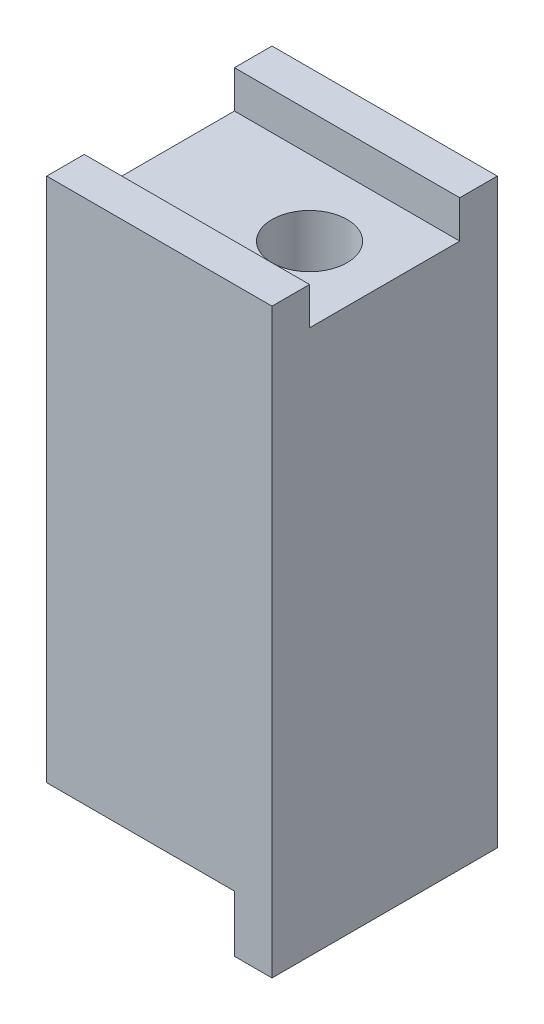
ISO-10303-21;
HEADER;
FILE_DESCRIPTION(('STEP AP214'),'2;1');
FILE_NAME('part.step','',(''),(''),'','','');
FILE_SCHEMA(('AUTOMOTIVE_DESIGN { 1 0 10303 214 1 1 1 1 }'));
ENDSEC;
DATA;
#1=APPLICATION_CONTEXT('core data for automotive mechanical design processes');
#2=APPLICATION_PROTOCOL_DEFINITION('international standard','automotive_design',2000,#1);
#3=PRODUCT_CONTEXT('',#1,'mechanical');
#4=PRODUCT('Part','Part','',(#3));
#5=PRODUCT_RELATED_PRODUCT_CATEGORY('part','',(#4));
#6=PRODUCT_DEFINITION_FORMATION('','',#4);
#7=PRODUCT_DEFINITION_CONTEXT('part definition',#1,'design');
#8=PRODUCT_DEFINITION('design','',#6,#7);
#9=PRODUCT_DEFINITION_SHAPE('','',#8);
#10=(LENGTH_UNIT() NAMED_UNIT(*) SI_UNIT(.MILLI.,.METRE.));
#11=(NAMED_UNIT(*) PLANE_ANGLE_UNIT() SI_UNIT($,.RADIAN.));
#12=(NAMED_UNIT(*) SI_UNIT($,.STERADIAN.) SOLID_ANGLE_UNIT());
#13=UNCERTAINTY_MEASURE_WITH_UNIT(LENGTH_MEASURE(1.E-05),#10,'distance_accuracy_value','');
#14=(GEOMETRIC_REPRESENTATION_CONTEXT(3) GLOBAL_UNCERTAINTY_ASSIGNED_CONTEXT((#13)) GLOBAL_UNIT_ASSIGNED_CONTEXT((#10,
#11,#12)) REPRESENTATION_CONTEXT('',''));
#15=CARTESIAN_POINT('',(0.,0.,0.));
#16=DIRECTION('',(0.,0.,1.));
#17=DIRECTION('',(1.,0.,0.));
#18=AXIS2_PLACEMENT_3D('',#15,#16,#17);
#19=CARTESIAN_POINT('',(-9.525,0.,9.525));
#20=DIRECTION('',(0.,-1.,0.));
#21=DIRECTION('',(0.,0.,-1.));
#22=AXIS2_PLACEMENT_3D('',#19,#20,#21);
#23=PLANE('',#22);
#24=DIRECTION('',(-1.,0.,0.));
#25=VECTOR('',#24,1.);
#26=CARTESIAN_POINT('',(-9.525,0.,6.35));
#27=LINE('',#26,#25);
#28=CARTESIAN_POINT('',(9.525,0.,6.35));
#29=VERTEX_POINT('',#28);
#30=CARTESIAN_POINT('',(-9.525,0.,6.35));
#31=VERTEX_POINT('',#30);
#32=EDGE_CURVE('E179',#29,#31,#27,.T.);
#33=ORIENTED_EDGE('',*,*,#32,.T.);
#34=DIRECTION('',(0.,0.,-1.));
#35=VECTOR('',#34,1.);
#36=CARTESIAN_POINT('',(-9.525,0.,9.525));
#37=LINE('',#36,#35);
#38=CARTESIAN_POINT('',(-9.525,0.,9.525));
#39=VERTEX_POINT('',#38);
#40=EDGE_CURVE('E147',#39,#31,#37,.T.);
#41=ORIENTED_EDGE('',*,*,#40,.F.);
#42=DIRECTION('',(-1.,0.,0.));
#43=VECTOR('',#42,1.);
#44=CARTESIAN_POINT('',(0.,0.,9.525));
#45=LINE('',#44,#43);
#46=CARTESIAN_POINT('',(9.525,0.,9.525));
#47=VERTEX_POINT('',#46);
#48=EDGE_CURVE('E92',#47,#39,#45,.T.);
#49=ORIENTED_EDGE('',*,*,#48,.F.);
#50=DIRECTION('',(0.,0.,-1.));
#51=VECTOR('',#50,1.);
#52=CARTESIAN_POINT('',(9.525,0.,9.525));
#53=LINE('',#52,#51);
#54=EDGE_CURVE('E11',#47,#29,#53,.T.);
#55=ORIENTED_EDGE('',*,*,#54,.T.);
#56=EDGE_LOOP('',(#33,#41,#49,#55));
#57=FACE_BOUND('',#56,.T.);
#58=ADVANCED_FACE('F33',(#57),#23,.F.);
#59=CARTESIAN_POINT('',(9.525,0.,9.525));
#60=DIRECTION('',(-1.,0.,0.));
#61=DIRECTION('',(0.,-1.,0.));
#62=AXIS2_PLACEMENT_3D('',#59,#60,#61);
#63=PLANE('',#62);
#64=CARTESIAN_POINT('',(9.525,0.,-6.35));
#65=VERTEX_POINT('',#64);
#66=CARTESIAN_POINT('',(9.525,0.,-9.525));
#67=VERTEX_POINT('',#66);
#68=EDGE_CURVE('E41',#65,#67,#53,.T.);
#69=ORIENTED_EDGE('',*,*,#68,.F.);
#70=DIRECTION('',(0.,1.,0.));
#71=VECTOR('',#70,1.);
#72=CARTESIAN_POINT('',(9.525,0.,-6.35));
#73=LINE('',#72,#71);
#74=CARTESIAN_POINT('',(9.525,-3.175,-6.35));
#75=VERTEX_POINT('',#74);
#76=EDGE_CURVE('E190',#75,#65,#73,.T.);
#77=ORIENTED_EDGE('',*,*,#76,.F.);
#78=DIRECTION('',(0.,0.,1.));
#79=VECTOR('',#78,1.);
#80=CARTESIAN_POINT('',(9.525,-3.175,-6.35));
#81=LINE('',#80,#79);
#82=CARTESIAN_POINT('',(9.525,-3.175,6.35));
#83=VERTEX_POINT('',#82);
#84=EDGE_CURVE('E134',#75,#83,#81,.T.);
#85=ORIENTED_EDGE('',*,*,#84,.T.);
#86=DIRECTION('',(0.,1.,0.));
#87=VECTOR('',#86,1.);
#88=CARTESIAN_POINT('',(9.525,0.,6.35));
#89=LINE('',#88,#87);
#90=EDGE_CURVE('E182',#83,#29,#89,.T.);
#91=ORIENTED_EDGE('',*,*,#90,.T.);
#92=ORIENTED_EDGE('',*,*,#54,.F.);
#93=DIRECTION('',(0.,1.,0.));
#94=VECTOR('',#93,1.);
#95=CARTESIAN_POINT('',(9.525,0.,9.525));
#96=LINE('',#95,#94);
#97=CARTESIAN_POINT('',(9.52500000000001,-49.1998,9.525));
#98=VERTEX_POINT('',#97);
#99=EDGE_CURVE('E143',#98,#47,#96,.T.);
#100=ORIENTED_EDGE('',*,*,#99,.F.);
#101=DIRECTION('',(0.,0.,-1.));
#102=VECTOR('',#101,1.);
#103=CARTESIAN_POINT('',(9.52500000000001,-49.1998,9.525));
#104=LINE('',#103,#102);
#105=CARTESIAN_POINT('',(9.52500000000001,-49.1998,-9.525));
#106=VERTEX_POINT('',#105);
#107=EDGE_CURVE('E126',#98,#106,#104,.T.);
#108=ORIENTED_EDGE('',*,*,#107,.T.);
#109=DIRECTION('',(0.,1.,0.));
#110=VECTOR('',#109,1.);
#111=CARTESIAN_POINT('',(9.525,0.,-9.525));
#112=LINE('',#111,#110);
#113=EDGE_CURVE('E130',#106,#67,#112,.T.);
#114=ORIENTED_EDGE('',*,*,#113,.T.);
#115=EDGE_LOOP('',(#69,#77,#85,#91,#92,#100,#108,#114));
#116=FACE_BOUND('',#115,.T.);
#117=ADVANCED_FACE('F35',(#116),#63,.F.);
#118=CARTESIAN_POINT('',(-9.525,0.,-6.35));
#119=VERTEX_POINT('',#118);
#120=CARTESIAN_POINT('',(-9.525,0.,-9.525));
#121=VERTEX_POINT('',#120);
#122=EDGE_CURVE('E146',#119,#121,#37,.T.);
#123=ORIENTED_EDGE('',*,*,#122,.F.);
#124=DIRECTION('',(-1.,0.,0.));
#125=VECTOR('',#124,1.);
#126=CARTESIAN_POINT('',(0.,0.,-6.35));
#127=LINE('',#126,#125);
#128=EDGE_CURVE('E176',#65,#119,#127,.T.);
#129=ORIENTED_EDGE('',*,*,#128,.F.);
#130=ORIENTED_EDGE('',*,*,#68,.T.);
#131=DIRECTION('',(-1.,0.,0.));
#132=VECTOR('',#131,1.);
#133=CARTESIAN_POINT('',(-9.525,0.,-9.525));
#134=LINE('',#133,#132);
#135=EDGE_CURVE('E133',#67,#121,#134,.T.);
#136=ORIENTED_EDGE('',*,*,#135,.T.);
#137=EDGE_LOOP('',(#123,#129,#130,#136));
#138=FACE_BOUND('',#137,.T.);
#139=ADVANCED_FACE('F161',(#138),#23,.F.);
#140=CARTESIAN_POINT('',(-9.525,-44.4246,9.525));
#141=DIRECTION('',(1.,0.,0.));
#142=DIRECTION('',(0.,1.,0.));
#143=AXIS2_PLACEMENT_3D('',#140,#141,#142);
#144=PLANE('',#143);
#145=DIRECTION('',(0.,0.,1.));
#146=VECTOR('',#145,1.);
#147=CARTESIAN_POINT('',(-9.525,-3.175,-6.35));
#148=LINE('',#147,#146);
#149=CARTESIAN_POINT('',(-9.525,-3.175,-6.35));
#150=VERTEX_POINT('',#149);
#151=CARTESIAN_POINT('',(-9.525,-3.175,6.35));
#152=VERTEX_POINT('',#151);
#153=EDGE_CURVE('E174',#150,#152,#148,.T.);
#154=ORIENTED_EDGE('',*,*,#153,.F.);
#155=DIRECTION('',(0.,-1.,0.));
#156=VECTOR('',#155,1.);
#157=CARTESIAN_POINT('',(-9.525,-3.175,-6.35));
#158=LINE('',#157,#156);
#159=EDGE_CURVE('E157',#119,#150,#158,.T.);
#160=ORIENTED_EDGE('',*,*,#159,.F.);
#161=ORIENTED_EDGE('',*,*,#122,.T.);
#162=DIRECTION('',(0.,-1.,0.));
#163=VECTOR('',#162,1.);
#164=CARTESIAN_POINT('',(-9.525,-44.4246,-9.525));
#165=LINE('',#164,#163);
#166=CARTESIAN_POINT('',(-9.525,-44.4246,-9.525));
#167=VERTEX_POINT('',#166);
#168=EDGE_CURVE('E137',#121,#167,#165,.T.);
#169=ORIENTED_EDGE('',*,*,#168,.T.);
#170=DIRECTION('',(0.,0.,-1.));
#171=VECTOR('',#170,1.);
#172=CARTESIAN_POINT('',(-9.525,-44.4246,9.525));
#173=LINE('',#172,#171);
#174=CARTESIAN_POINT('',(-9.525,-44.4246,9.525));
#175=VERTEX_POINT('',#174);
#176=EDGE_CURVE('E121',#175,#167,#173,.T.);
#177=ORIENTED_EDGE('',*,*,#176,.F.);
#178=DIRECTION('',(0.,-1.,0.));
#179=VECTOR('',#178,1.);
#180=CARTESIAN_POINT('',(-9.525,-44.4246,9.525));
#181=LINE('',#180,#179);
#182=EDGE_CURVE('E109',#39,#175,#181,.T.);
#183=ORIENTED_EDGE('',*,*,#182,.F.);
#184=ORIENTED_EDGE('',*,*,#40,.T.);
#185=DIRECTION('',(0.,-1.,0.));
#186=VECTOR('',#185,1.);
#187=CARTESIAN_POINT('',(-9.525,-3.175,6.35));
#188=LINE('',#187,#186);
#189=EDGE_CURVE('E185',#31,#152,#188,.T.);
#190=ORIENTED_EDGE('',*,*,#189,.T.);
#191=EDGE_LOOP('',(#154,#160,#161,#169,#177,#183,#184,#190));
#192=FACE_BOUND('',#191,.T.);
#193=ADVANCED_FACE('F154',(#192),#144,.F.);
#194=CARTESIAN_POINT('',(6.35000000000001,-44.4246,9.525));
#195=DIRECTION('',(0.,1.,0.));
#196=DIRECTION('',(0.,0.,1.));
#197=AXIS2_PLACEMENT_3D('',#194,#195,#196);
#198=PLANE('',#197);
#199=CARTESIAN_POINT('',(-3.17499999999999,-44.4246,0.));
#200=DIRECTION('',(0.,-1.,0.));
#201=DIRECTION('',(0.,0.,-1.));
#202=AXIS2_PLACEMENT_3D('',#199,#200,#201);
#203=CIRCLE('',#202,3.17499999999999);
#204=CARTESIAN_POINT('',(-3.17499999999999,-44.4246,-3.17499999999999));
#205=VERTEX_POINT('',#204);
#206=EDGE_CURVE('E217',#205,#205,#203,.T.);
#207=ORIENTED_EDGE('',*,*,#206,.F.);
#208=EDGE_LOOP('',(#207));
#209=FACE_BOUND('',#208,.T.);
#210=DIRECTION('',(1.,0.,0.));
#211=VECTOR('',#210,1.);
#212=CARTESIAN_POINT('',(6.35000000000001,-44.4246,-9.525));
#213=LINE('',#212,#211);
#214=CARTESIAN_POINT('',(6.35000000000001,-44.4246,-9.525));
#215=VERTEX_POINT('',#214);
#216=EDGE_CURVE('E118',#167,#215,#213,.T.);
#217=ORIENTED_EDGE('',*,*,#216,.T.);
#218=DIRECTION('',(0.,0.,-1.));
#219=VECTOR('',#218,1.);
#220=CARTESIAN_POINT('',(6.35000000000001,-44.4246,9.525));
#221=LINE('',#220,#219);
#222=CARTESIAN_POINT('',(6.35000000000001,-44.4246,9.525));
#223=VERTEX_POINT('',#222);
#224=EDGE_CURVE('E115',#223,#215,#221,.T.);
#225=ORIENTED_EDGE('',*,*,#224,.F.);
#226=DIRECTION('',(1.,0.,0.));
#227=VECTOR('',#226,1.);
#228=CARTESIAN_POINT('',(6.35000000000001,-44.4246,9.525));
#229=LINE('',#228,#227);
#230=EDGE_CURVE('E102',#175,#223,#229,.T.);
#231=ORIENTED_EDGE('',*,*,#230,.F.);
#232=ORIENTED_EDGE('',*,*,#176,.T.);
#233=EDGE_LOOP('',(#217,#225,#231,#232));
#234=FACE_BOUND('',#233,.T.);
#235=ADVANCED_FACE('F116',(#209,#234),#198,.F.);
#236=CARTESIAN_POINT('',(6.35000000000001,-49.1998,9.525));
#237=DIRECTION('',(1.,0.,0.));
#238=DIRECTION('',(0.,0.,-1.));
#239=AXIS2_PLACEMENT_3D('',#236,#237,#238);
#240=PLANE('',#239);
#241=DIRECTION('',(0.,-1.,0.));
#242=VECTOR('',#241,1.);
#243=CARTESIAN_POINT('',(6.35000000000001,-49.1998,-9.525));
#244=LINE('',#243,#242);
#245=CARTESIAN_POINT('',(6.35000000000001,-49.1998,-9.525));
#246=VERTEX_POINT('',#245);
#247=EDGE_CURVE('E140',#215,#246,#244,.T.);
#248=ORIENTED_EDGE('',*,*,#247,.T.);
#249=DIRECTION('',(0.,0.,-1.));
#250=VECTOR('',#249,1.);
#251=CARTESIAN_POINT('',(6.35000000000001,-49.1998,9.525));
#252=LINE('',#251,#250);
#253=CARTESIAN_POINT('',(6.35000000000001,-49.1998,9.525));
#254=VERTEX_POINT('',#253);
#255=EDGE_CURVE('E122',#254,#246,#252,.T.);
#256=ORIENTED_EDGE('',*,*,#255,.F.);
#257=DIRECTION('',(0.,-1.,0.));
#258=VECTOR('',#257,1.);
#259=CARTESIAN_POINT('',(6.35000000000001,-49.1998,9.525));
#260=LINE('',#259,#258);
#261=EDGE_CURVE('E106',#223,#254,#260,.T.);
#262=ORIENTED_EDGE('',*,*,#261,.F.);
#263=ORIENTED_EDGE('',*,*,#224,.T.);
#264=EDGE_LOOP('',(#248,#256,#262,#263));
#265=FACE_BOUND('',#264,.T.);
#266=ADVANCED_FACE('F124',(#265),#240,.F.);
#267=CARTESIAN_POINT('',(9.52500000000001,-49.1998,9.525));
#268=DIRECTION('',(0.,1.,0.));
#269=DIRECTION('',(0.,0.,1.));
#270=AXIS2_PLACEMENT_3D('',#267,#268,#269);
#271=PLANE('',#270);
#272=DIRECTION('',(1.,0.,0.));
#273=VECTOR('',#272,1.);
#274=CARTESIAN_POINT('',(9.52500000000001,-49.1998,-9.525));
#275=LINE('',#274,#273);
#276=EDGE_CURVE('E84',#246,#106,#275,.T.);
#277=ORIENTED_EDGE('',*,*,#276,.T.);
#278=ORIENTED_EDGE('',*,*,#107,.F.);
#279=DIRECTION('',(1.,0.,0.));
#280=VECTOR('',#279,1.);
#281=CARTESIAN_POINT('',(9.52500000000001,-49.1998,9.525));
#282=LINE('',#281,#280);
#283=EDGE_CURVE('E57',#254,#98,#282,.T.);
#284=ORIENTED_EDGE('',*,*,#283,.F.);
#285=ORIENTED_EDGE('',*,*,#255,.T.);
#286=EDGE_LOOP('',(#277,#278,#284,#285));
#287=FACE_BOUND('',#286,.T.);
#288=ADVANCED_FACE('F166',(#287),#271,.F.);
#289=CARTESIAN_POINT('',(0.,0.,9.525));
#290=DIRECTION('',(0.,0.,-1.));
#291=DIRECTION('',(-1.,0.,0.));
#292=AXIS2_PLACEMENT_3D('',#289,#290,#291);
#293=PLANE('',#292);
#294=ORIENTED_EDGE('',*,*,#99,.T.);
#295=ORIENTED_EDGE('',*,*,#48,.T.);
#296=ORIENTED_EDGE('',*,*,#182,.T.);
#297=ORIENTED_EDGE('',*,*,#230,.T.);
#298=ORIENTED_EDGE('',*,*,#261,.T.);
#299=ORIENTED_EDGE('',*,*,#283,.T.);
#300=EDGE_LOOP('',(#294,#295,#296,#297,#298,#299));
#301=FACE_BOUND('',#300,.T.);
#302=ADVANCED_FACE('F104',(#301),#293,.F.);
#303=CARTESIAN_POINT('',(0.,0.,-9.525));
#304=DIRECTION('',(0.,0.,-1.));
#305=DIRECTION('',(-1.,0.,0.));
#306=AXIS2_PLACEMENT_3D('',#303,#304,#305);
#307=PLANE('',#306);
#308=ORIENTED_EDGE('',*,*,#113,.F.);
#309=ORIENTED_EDGE('',*,*,#276,.F.);
#310=ORIENTED_EDGE('',*,*,#247,.F.);
#311=ORIENTED_EDGE('',*,*,#216,.F.);
#312=ORIENTED_EDGE('',*,*,#168,.F.);
#313=ORIENTED_EDGE('',*,*,#135,.F.);
#314=EDGE_LOOP('',(#308,#309,#310,#311,#312,#313));
#315=FACE_BOUND('',#314,.T.);
#316=ADVANCED_FACE('F165',(#315),#307,.T.);
#317=CARTESIAN_POINT('',(-9.525,-3.175,-6.35));
#318=DIRECTION('',(0.,-1.,0.));
#319=DIRECTION('',(1.,0.,0.));
#320=AXIS2_PLACEMENT_3D('',#317,#318,#319);
#321=PLANE('',#320);
#322=CARTESIAN_POINT('',(3.175,-3.17499999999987,0.));
#323=DIRECTION('',(0.,1.,0.));
#324=DIRECTION('',(0.,0.,1.));
#325=AXIS2_PLACEMENT_3D('',#322,#323,#324);
#326=CIRCLE('',#325,3.17499999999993);
#327=CARTESIAN_POINT('',(3.175,-3.17499999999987,3.17499999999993));
#328=VERTEX_POINT('',#327);
#329=EDGE_CURVE('E205',#328,#328,#326,.T.);
#330=ORIENTED_EDGE('',*,*,#329,.F.);
#331=EDGE_LOOP('',(#330));
#332=FACE_BOUND('',#331,.T.);
#333=DIRECTION('',(1.,0.,0.));
#334=VECTOR('',#333,1.);
#335=CARTESIAN_POINT('',(-9.525,-3.175,6.35));
#336=LINE('',#335,#334);
#337=EDGE_CURVE('E48',#152,#83,#336,.T.);
#338=ORIENTED_EDGE('',*,*,#337,.T.);
#339=ORIENTED_EDGE('',*,*,#84,.F.);
#340=DIRECTION('',(1.,0.,0.));
#341=VECTOR('',#340,1.);
#342=CARTESIAN_POINT('',(-9.525,-3.175,-6.35));
#343=LINE('',#342,#341);
#344=EDGE_CURVE('E193',#150,#75,#343,.T.);
#345=ORIENTED_EDGE('',*,*,#344,.F.);
#346=ORIENTED_EDGE('',*,*,#153,.T.);
#347=EDGE_LOOP('',(#338,#339,#345,#346));
#348=FACE_BOUND('',#347,.T.);
#349=ADVANCED_FACE('F256',(#332,#348),#321,.F.);
#350=CARTESIAN_POINT('',(0.,0.,-6.35));
#351=DIRECTION('',(0.,0.,-1.));
#352=DIRECTION('',(-1.,0.,0.));
#353=AXIS2_PLACEMENT_3D('',#350,#351,#352);
#354=PLANE('',#353);
#355=ORIENTED_EDGE('',*,*,#159,.T.);
#356=ORIENTED_EDGE('',*,*,#344,.T.);
#357=ORIENTED_EDGE('',*,*,#76,.T.);
#358=ORIENTED_EDGE('',*,*,#128,.T.);
#359=EDGE_LOOP('',(#355,#356,#357,#358));
#360=FACE_BOUND('',#359,.T.);
#361=ADVANCED_FACE('F250',(#360),#354,.F.);
#362=CARTESIAN_POINT('',(0.,0.,6.35));
#363=DIRECTION('',(0.,0.,-1.));
#364=DIRECTION('',(-1.,0.,0.));
#365=AXIS2_PLACEMENT_3D('',#362,#363,#364);
#366=PLANE('',#365);
#367=ORIENTED_EDGE('',*,*,#189,.F.);
#368=ORIENTED_EDGE('',*,*,#32,.F.);
#369=ORIENTED_EDGE('',*,*,#90,.F.);
#370=ORIENTED_EDGE('',*,*,#337,.F.);
#371=EDGE_LOOP('',(#367,#368,#369,#370));
#372=FACE_BOUND('',#371,.T.);
#373=ADVANCED_FACE('F255',(#372),#366,.T.);
#374=CARTESIAN_POINT('',(3.175,-19.685,0.));
#375=DIRECTION('',(0.,1.,0.));
#376=DIRECTION('',(0.,0.,1.));
#377=AXIS2_PLACEMENT_3D('',#374,#375,#376);
#378=CONICAL_SURFACE('',#377,2.55269999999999,1.02974425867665);
#379=CARTESIAN_POINT('',(3.175,-21.2188169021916,0.));
#380=VERTEX_POINT('',#379);
#381=VERTEX_LOOP('',#380);
#382=FACE_BOUND('',#381,.T.);
#383=CARTESIAN_POINT('',(3.175,-19.685,0.));
#384=DIRECTION('',(0.,1.,0.));
#385=DIRECTION('',(0.,0.,1.));
#386=AXIS2_PLACEMENT_3D('',#383,#384,#385);
#387=CIRCLE('',#386,2.55269999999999);
#388=CARTESIAN_POINT('',(3.175,-19.685,2.55269999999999));
#389=VERTEX_POINT('',#388);
#390=EDGE_CURVE('E187',#389,#389,#387,.T.);
#391=ORIENTED_EDGE('',*,*,#390,.T.);
#392=EDGE_LOOP('',(#391));
#393=FACE_BOUND('',#392,.T.);
#394=ADVANCED_FACE('F268',(#382,#393),#378,.F.);
#395=CARTESIAN_POINT('',(3.175,-3.175,0.));
#396=DIRECTION('',(0.,1.,0.));
#397=DIRECTION('',(0.,0.,1.));
#398=AXIS2_PLACEMENT_3D('',#395,#396,#397);
#399=CYLINDRICAL_SURFACE('',#398,2.55269999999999);
#400=ORIENTED_EDGE('',*,*,#390,.F.);
#401=EDGE_LOOP('',(#400));
#402=FACE_BOUND('',#401,.T.);
#403=CARTESIAN_POINT('',(3.175,-15.875,0.));
#404=DIRECTION('',(0.,1.,0.));
#405=DIRECTION('',(0.,0.,1.));
#406=AXIS2_PLACEMENT_3D('',#403,#404,#405);
#407=CIRCLE('',#406,2.5527);
#408=CARTESIAN_POINT('',(3.175,-15.875,2.5527));
#409=VERTEX_POINT('',#408);
#410=EDGE_CURVE('E199',#409,#409,#407,.T.);
#411=ORIENTED_EDGE('',*,*,#410,.T.);
#412=EDGE_LOOP('',(#411));
#413=FACE_BOUND('',#412,.T.);
#414=ADVANCED_FACE('F286',(#402,#413),#399,.F.);
#415=CARTESIAN_POINT('',(5.7277,-15.875,0.));
#416=DIRECTION('',(0.,-1.,0.));
#417=DIRECTION('',(0.,0.,-1.));
#418=AXIS2_PLACEMENT_3D('',#415,#416,#417);
#419=PLANE('',#418);
#420=ORIENTED_EDGE('',*,*,#410,.F.);
#421=EDGE_LOOP('',(#420));
#422=FACE_BOUND('',#421,.T.);
#423=CARTESIAN_POINT('',(3.175,-15.875,0.));
#424=DIRECTION('',(0.,1.,0.));
#425=DIRECTION('',(0.,0.,1.));
#426=AXIS2_PLACEMENT_3D('',#423,#424,#425);
#427=CIRCLE('',#426,3.17499999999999);
#428=CARTESIAN_POINT('',(3.175,-15.875,3.17499999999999));
#429=VERTEX_POINT('',#428);
#430=EDGE_CURVE('E202',#429,#429,#427,.T.);
#431=ORIENTED_EDGE('',*,*,#430,.T.);
#432=EDGE_LOOP('',(#431));
#433=FACE_BOUND('',#432,.T.);
#434=ADVANCED_FACE('F296',(#422,#433),#419,.F.);
#435=CARTESIAN_POINT('',(3.175,-3.175,0.));
#436=DIRECTION('',(0.,1.,0.));
#437=DIRECTION('',(0.,0.,1.));
#438=AXIS2_PLACEMENT_3D('',#435,#436,#437);
#439=CYLINDRICAL_SURFACE('',#438,3.17499999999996);
#440=ORIENTED_EDGE('',*,*,#430,.F.);
#441=EDGE_LOOP('',(#440));
#442=FACE_BOUND('',#441,.T.);
#443=ORIENTED_EDGE('',*,*,#329,.T.);
#444=EDGE_LOOP('',(#443));
#445=FACE_BOUND('',#444,.T.);
#446=ADVANCED_FACE('F306',(#442,#445),#439,.F.);
#447=CARTESIAN_POINT('',(-3.17499999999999,-27.9146,0.));
#448=DIRECTION('',(0.,-1.,0.));
#449=DIRECTION('',(0.,0.,-1.));
#450=AXIS2_PLACEMENT_3D('',#447,#448,#449);
#451=CONICAL_SURFACE('',#450,2.55269999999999,1.02974425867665);
#452=CARTESIAN_POINT('',(-3.175,-26.3807830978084,0.));
#453=VERTEX_POINT('',#452);
#454=VERTEX_LOOP('',#453);
#455=FACE_BOUND('',#454,.T.);
#456=CARTESIAN_POINT('',(-3.17499999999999,-27.9146,0.));
#457=DIRECTION('',(0.,-1.,0.));
#458=DIRECTION('',(0.,0.,-1.));
#459=AXIS2_PLACEMENT_3D('',#456,#457,#458);
#460=CIRCLE('',#459,2.55269999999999);
#461=CARTESIAN_POINT('',(-3.17499999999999,-27.9146,-2.55269999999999));
#462=VERTEX_POINT('',#461);
#463=EDGE_CURVE('E208',#462,#462,#460,.T.);
#464=ORIENTED_EDGE('',*,*,#463,.T.);
#465=EDGE_LOOP('',(#464));
#466=FACE_BOUND('',#465,.T.);
#467=ADVANCED_FACE('F315',(#455,#466),#451,.F.);
#468=CARTESIAN_POINT('',(-3.17499999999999,-44.4246,0.));
#469=DIRECTION('',(0.,-1.,0.));
#470=DIRECTION('',(0.,0.,-1.));
#471=AXIS2_PLACEMENT_3D('',#468,#469,#470);
#472=CYLINDRICAL_SURFACE('',#471,2.55269999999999);
#473=ORIENTED_EDGE('',*,*,#463,.F.);
#474=EDGE_LOOP('',(#473));
#475=FACE_BOUND('',#474,.T.);
#476=CARTESIAN_POINT('',(-3.17499999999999,-31.7246,0.));
#477=DIRECTION('',(0.,-1.,0.));
#478=DIRECTION('',(0.,0.,-1.));
#479=AXIS2_PLACEMENT_3D('',#476,#477,#478);
#480=CIRCLE('',#479,2.55269999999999);
#481=CARTESIAN_POINT('',(-3.17499999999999,-31.7246,-2.55269999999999));
#482=VERTEX_POINT('',#481);
#483=EDGE_CURVE('E211',#482,#482,#480,.T.);
#484=ORIENTED_EDGE('',*,*,#483,.T.);
#485=EDGE_LOOP('',(#484));
#486=FACE_BOUND('',#485,.T.);
#487=ADVANCED_FACE('F330',(#475,#486),#472,.F.);
#488=CARTESIAN_POINT('',(-0.622300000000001,-31.7246,0.));
#489=DIRECTION('',(0.,1.,0.));
#490=DIRECTION('',(0.,0.,1.));
#491=AXIS2_PLACEMENT_3D('',#488,#489,#490);
#492=PLANE('',#491);
#493=ORIENTED_EDGE('',*,*,#483,.F.);
#494=EDGE_LOOP('',(#493));
#495=FACE_BOUND('',#494,.T.);
#496=CARTESIAN_POINT('',(-3.17499999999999,-31.7246,0.));
#497=DIRECTION('',(0.,-1.,0.));
#498=DIRECTION('',(0.,0.,-1.));
#499=AXIS2_PLACEMENT_3D('',#496,#497,#498);
#500=CIRCLE('',#499,3.17499999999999);
#501=CARTESIAN_POINT('',(-3.17499999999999,-31.7246,-3.17499999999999));
#502=VERTEX_POINT('',#501);
#503=EDGE_CURVE('E214',#502,#502,#500,.T.);
#504=ORIENTED_EDGE('',*,*,#503,.T.);
#505=EDGE_LOOP('',(#504));
#506=FACE_BOUND('',#505,.T.);
#507=ADVANCED_FACE('F340',(#495,#506),#492,.F.);
#508=CARTESIAN_POINT('',(-3.17499999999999,-44.4246,0.));
#509=DIRECTION('',(0.,-1.,0.));
#510=DIRECTION('',(0.,0.,-1.));
#511=AXIS2_PLACEMENT_3D('',#508,#509,#510);
#512=CYLINDRICAL_SURFACE('',#511,3.17499999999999);
#513=ORIENTED_EDGE('',*,*,#503,.F.);
#514=EDGE_LOOP('',(#513));
#515=FACE_BOUND('',#514,.T.);
#516=ORIENTED_EDGE('',*,*,#206,.T.);
#517=EDGE_LOOP('',(#516));
#518=FACE_BOUND('',#517,.T.);
#519=ADVANCED_FACE('F221',(#515,#518),#512,.F.);
#520=CLOSED_SHELL('',(#58,#117,#139,#193,#235,#266,#288,#302,#316,#349,#361,#373,#394,#414,#434,
#446,#467,#487,#507,#519));
#521=MANIFOLD_SOLID_BREP('B2',#520);
#522=ADVANCED_BREP_SHAPE_REPRESENTATION('',(#18,#521),#14);
#523=SHAPE_DEFINITION_REPRESENTATION(#9,#522);
ENDSEC;
END-ISO-10303-21;
